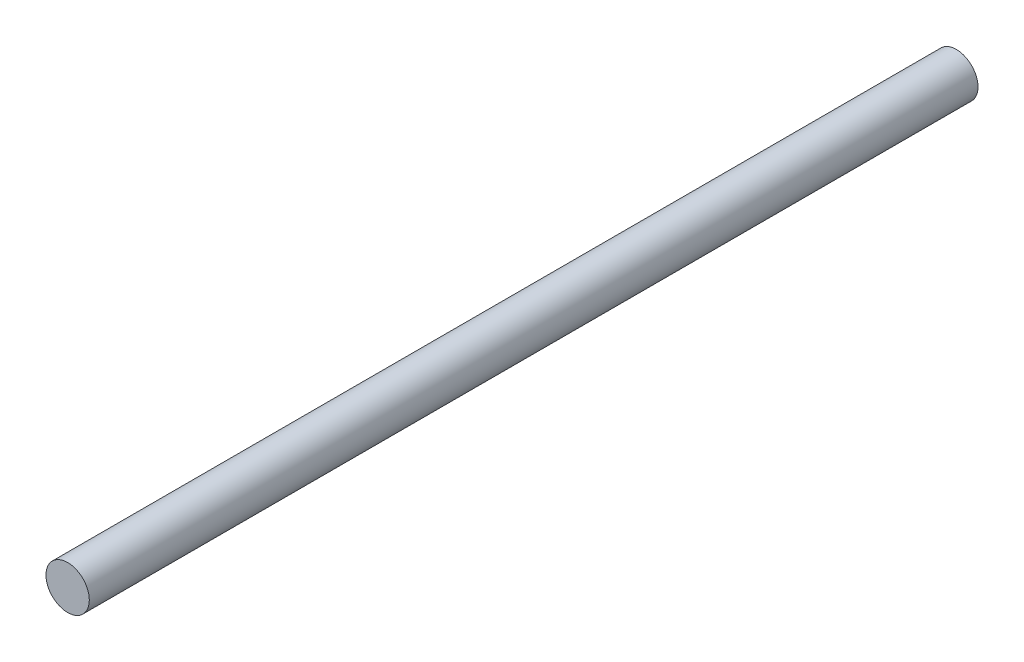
ISO-10303-21;
HEADER;
FILE_DESCRIPTION(('STEP AP214'),'2;1');
FILE_NAME('part.step','',(''),(''),'','','');
FILE_SCHEMA(('AUTOMOTIVE_DESIGN { 1 0 10303 214 1 1 1 1 }'));
ENDSEC;
DATA;
#1=APPLICATION_CONTEXT('core data for automotive mechanical design processes');
#2=APPLICATION_PROTOCOL_DEFINITION('international standard','automotive_design',2000,#1);
#3=PRODUCT_CONTEXT('',#1,'mechanical');
#4=PRODUCT('Part','Part','',(#3));
#5=PRODUCT_RELATED_PRODUCT_CATEGORY('part','',(#4));
#6=PRODUCT_DEFINITION_FORMATION('','',#4);
#7=PRODUCT_DEFINITION_CONTEXT('part definition',#1,'design');
#8=PRODUCT_DEFINITION('design','',#6,#7);
#9=PRODUCT_DEFINITION_SHAPE('','',#8);
#10=(LENGTH_UNIT() NAMED_UNIT(*) SI_UNIT(.MILLI.,.METRE.));
#11=(NAMED_UNIT(*) PLANE_ANGLE_UNIT() SI_UNIT($,.RADIAN.));
#12=(NAMED_UNIT(*) SI_UNIT($,.STERADIAN.) SOLID_ANGLE_UNIT());
#13=UNCERTAINTY_MEASURE_WITH_UNIT(LENGTH_MEASURE(1.E-05),#10,'distance_accuracy_value','');
#14=(GEOMETRIC_REPRESENTATION_CONTEXT(3) GLOBAL_UNCERTAINTY_ASSIGNED_CONTEXT((#13)) GLOBAL_UNIT_ASSIGNED_CONTEXT((#10,
#11,#12)) REPRESENTATION_CONTEXT('',''));
#15=CARTESIAN_POINT('',(0.,0.,0.));
#16=DIRECTION('',(0.,0.,1.));
#17=DIRECTION('',(1.,0.,0.));
#18=AXIS2_PLACEMENT_3D('',#15,#16,#17);
#19=CARTESIAN_POINT('',(0.,0.,130.175));
#20=DIRECTION('',(0.,0.,-1.));
#21=DIRECTION('',(-1.,0.,0.));
#22=AXIS2_PLACEMENT_3D('',#19,#20,#21);
#23=CYLINDRICAL_SURFACE('',#22,6.35);
#24=CARTESIAN_POINT('',(0.,0.,130.175));
#25=DIRECTION('',(0.,0.,1.));
#26=DIRECTION('',(1.,0.,0.));
#27=AXIS2_PLACEMENT_3D('',#24,#25,#26);
#28=CIRCLE('',#27,6.35);
#29=CARTESIAN_POINT('',(6.35,0.,130.175));
#30=VERTEX_POINT('',#29);
#31=EDGE_CURVE('E10',#30,#30,#28,.T.);
#32=ORIENTED_EDGE('',*,*,#31,.F.);
#33=EDGE_LOOP('',(#32));
#34=FACE_BOUND('',#33,.T.);
#35=CARTESIAN_POINT('',(0.,0.,-130.175));
#36=DIRECTION('',(0.,0.,1.));
#37=DIRECTION('',(1.,0.,0.));
#38=AXIS2_PLACEMENT_3D('',#35,#36,#37);
#39=CIRCLE('',#38,6.35);
#40=CARTESIAN_POINT('',(6.35,0.,-130.175));
#41=VERTEX_POINT('',#40);
#42=EDGE_CURVE('E41',#41,#41,#39,.T.);
#43=ORIENTED_EDGE('',*,*,#42,.T.);
#44=EDGE_LOOP('',(#43));
#45=FACE_BOUND('',#44,.T.);
#46=ADVANCED_FACE('F35',(#34,#45),#23,.T.);
#47=CARTESIAN_POINT('',(0.,0.,130.175));
#48=DIRECTION('',(0.,0.,1.));
#49=DIRECTION('',(1.,0.,0.));
#50=AXIS2_PLACEMENT_3D('',#47,#48,#49);
#51=PLANE('',#50);
#52=ORIENTED_EDGE('',*,*,#31,.T.);
#53=EDGE_LOOP('',(#52));
#54=FACE_BOUND('',#53,.T.);
#55=ADVANCED_FACE('F50',(#54),#51,.T.);
#56=CARTESIAN_POINT('',(0.,0.,-130.175));
#57=DIRECTION('',(0.,0.,1.));
#58=DIRECTION('',(1.,0.,0.));
#59=AXIS2_PLACEMENT_3D('',#56,#57,#58);
#60=PLANE('',#59);
#61=ORIENTED_EDGE('',*,*,#42,.F.);
#62=EDGE_LOOP('',(#61));
#63=FACE_BOUND('',#62,.T.);
#64=ADVANCED_FACE('F48',(#63),#60,.F.);
#65=CLOSED_SHELL('',(#46,#55,#64));
#66=MANIFOLD_SOLID_BREP('B2',#65);
#67=ADVANCED_BREP_SHAPE_REPRESENTATION('',(#18,#66),#14);
#68=SHAPE_DEFINITION_REPRESENTATION(#9,#67);
ENDSEC;
END-ISO-10303-21;
